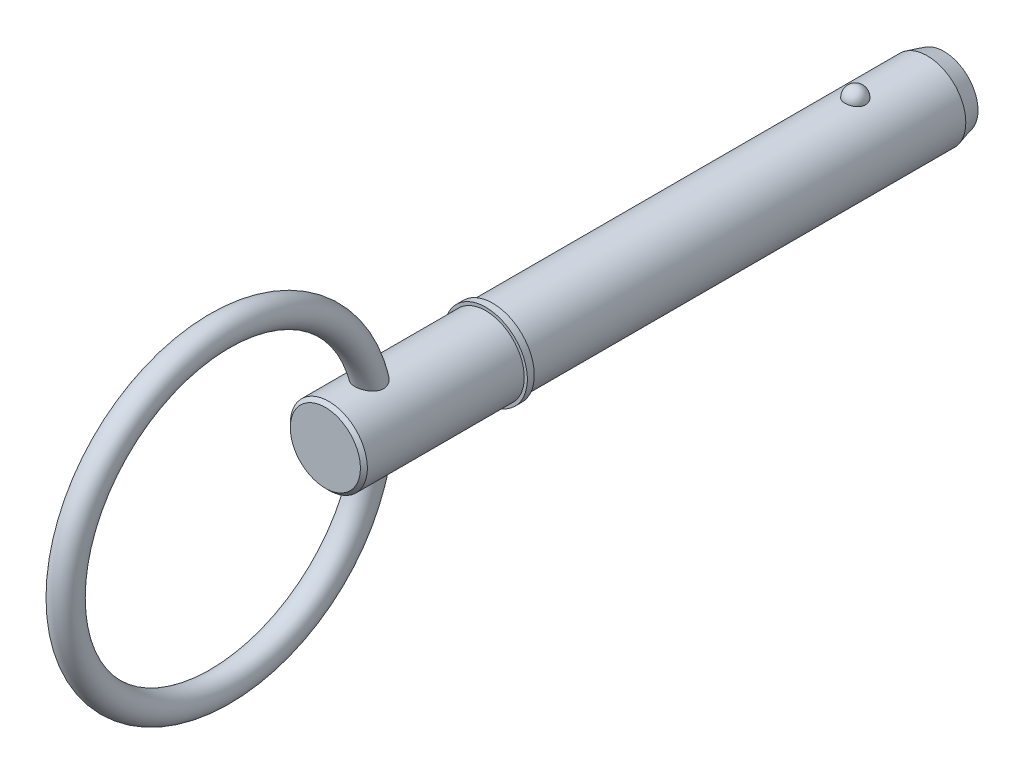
ISO-10303-21;
HEADER;
FILE_DESCRIPTION(('STEP AP214'),'2;1');
FILE_NAME('part.step','',(''),(''),'','','');
FILE_SCHEMA(('AUTOMOTIVE_DESIGN { 1 0 10303 214 1 1 1 1 }'));
ENDSEC;
DATA;
#1=APPLICATION_CONTEXT('core data for automotive mechanical design processes');
#2=APPLICATION_PROTOCOL_DEFINITION('international standard','automotive_design',2000,#1);
#3=PRODUCT_CONTEXT('',#1,'mechanical');
#4=PRODUCT('Part','Part','',(#3));
#5=PRODUCT_RELATED_PRODUCT_CATEGORY('part','',(#4));
#6=PRODUCT_DEFINITION_FORMATION('','',#4);
#7=PRODUCT_DEFINITION_CONTEXT('part definition',#1,'design');
#8=PRODUCT_DEFINITION('design','',#6,#7);
#9=PRODUCT_DEFINITION_SHAPE('','',#8);
#10=(LENGTH_UNIT() NAMED_UNIT(*) SI_UNIT(.MILLI.,.METRE.));
#11=(NAMED_UNIT(*) PLANE_ANGLE_UNIT() SI_UNIT($,.RADIAN.));
#12=(NAMED_UNIT(*) SI_UNIT($,.STERADIAN.) SOLID_ANGLE_UNIT());
#13=UNCERTAINTY_MEASURE_WITH_UNIT(LENGTH_MEASURE(1.E-05),#10,'distance_accuracy_value','');
#14=(GEOMETRIC_REPRESENTATION_CONTEXT(3) GLOBAL_UNCERTAINTY_ASSIGNED_CONTEXT((#13)) GLOBAL_UNIT_ASSIGNED_CONTEXT((#10,
#11,#12)) REPRESENTATION_CONTEXT('',''));
#15=CARTESIAN_POINT('',(0.,0.,0.));
#16=DIRECTION('',(0.,0.,1.));
#17=DIRECTION('',(1.,0.,0.));
#18=AXIS2_PLACEMENT_3D('',#15,#16,#17);
#19=CARTESIAN_POINT('',(0.,0.,50.8));
#20=DIRECTION('',(0.,0.,-1.));
#21=DIRECTION('',(-1.,0.,0.));
#22=AXIS2_PLACEMENT_3D('',#19,#20,#21);
#23=CYLINDRICAL_SURFACE('',#22,5.555);
#24=CARTESIAN_POINT('',(1.47653932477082,5.35517101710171,-1.49));
#25=CARTESIAN_POINT('',(1.4765376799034,5.35517235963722,-1.40667872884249));
#26=CARTESIAN_POINT('',(1.4697233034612,5.35706459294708,-1.32333626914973));
#27=CARTESIAN_POINT('',(1.4426291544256,5.36442332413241,-1.15900769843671));
#28=CARTESIAN_POINT('',(1.42234344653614,5.36989139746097,-1.07802264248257));
#29=CARTESIAN_POINT('',(1.36882802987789,5.38378061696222,-0.920757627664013));
#30=CARTESIAN_POINT('',(1.33560404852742,5.39220045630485,-0.844475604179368));
#31=CARTESIAN_POINT('',(1.25704906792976,5.41105136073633,-0.69870312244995));
#32=CARTESIAN_POINT('',(1.21171855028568,5.42148234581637,-0.62921239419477));
#33=CARTESIAN_POINT('',(1.10986325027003,5.44324765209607,-0.498626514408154));
#34=CARTESIAN_POINT('',(1.05328868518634,5.45458585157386,-0.43757082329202));
#35=CARTESIAN_POINT('',(0.930545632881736,5.4768596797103,-0.325918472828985));
#36=CARTESIAN_POINT('',(0.864377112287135,5.48779530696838,-0.275321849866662));
#37=CARTESIAN_POINT('',(0.724412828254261,5.50801510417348,-0.186125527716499));
#38=CARTESIAN_POINT('',(0.650637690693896,5.51730356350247,-0.147494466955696));
#39=CARTESIAN_POINT('',(0.497383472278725,5.53322345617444,-0.0831582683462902));
#40=CARTESIAN_POINT('',(0.417904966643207,5.53985515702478,-0.0574518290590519));
#41=CARTESIAN_POINT('',(0.256903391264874,5.54963245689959,-0.0200294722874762));
#42=CARTESIAN_POINT('',(0.17543580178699,5.55283384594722,-0.00808940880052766));
#43=CARTESIAN_POINT('',(0.011588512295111,5.55559187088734,0.00221439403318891));
#44=CARTESIAN_POINT('',(-0.0707911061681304,5.55514883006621,0.000579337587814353));
#45=CARTESIAN_POINT('',(-0.232980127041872,5.55069756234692,-0.0161051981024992));
#46=CARTESIAN_POINT('',(-0.312809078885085,5.54673626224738,-0.0309781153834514));
#47=CARTESIAN_POINT('',(-0.468771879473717,5.5357377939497,-0.0734743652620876));
#48=CARTESIAN_POINT('',(-0.544905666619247,5.52870057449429,-0.101097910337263));
#49=CARTESIAN_POINT('',(-0.691800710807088,5.51225307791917,-0.168516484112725));
#50=CARTESIAN_POINT('',(-0.762530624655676,5.50283015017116,-0.208376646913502));
#51=CARTESIAN_POINT('',(-0.896294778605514,5.48263289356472,-0.299136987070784));
#52=CARTESIAN_POINT('',(-0.959328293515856,5.47185843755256,-0.350038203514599));
#53=CARTESIAN_POINT('',(-1.07712789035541,5.44990641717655,-0.462517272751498));
#54=CARTESIAN_POINT('',(-1.13172901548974,5.43872509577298,-0.524267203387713));
#55=CARTESIAN_POINT('',(-1.2299173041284,5.41736658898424,-0.6561336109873));
#56=CARTESIAN_POINT('',(-1.2735037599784,5.40718946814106,-0.726250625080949));
#57=CARTESIAN_POINT('',(-1.34896420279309,5.38886361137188,-0.873713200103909));
#58=CARTESIAN_POINT('',(-1.38071142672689,5.38073711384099,-0.951126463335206));
#59=CARTESIAN_POINT('',(-1.4310375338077,5.36757288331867,-1.11037033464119));
#60=CARTESIAN_POINT('',(-1.44961676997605,5.3625350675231,-1.19220082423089));
#61=CARTESIAN_POINT('',(-1.47308754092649,5.35613553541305,-1.35761209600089));
#62=CARTESIAN_POINT('',(-1.47803294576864,5.35475935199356,-1.44118467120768));
#63=CARTESIAN_POINT('',(-1.47426441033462,5.35579807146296,-1.6079958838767));
#64=CARTESIAN_POINT('',(-1.46555080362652,5.35821288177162,-1.69123452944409));
#65=CARTESIAN_POINT('',(-1.43475662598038,5.36653964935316,-1.8546288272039));
#66=CARTESIAN_POINT('',(-1.41273621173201,5.37243586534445,-1.93479663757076));
#67=CARTESIAN_POINT('',(-1.35593151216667,5.38705199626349,-2.0902011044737));
#68=CARTESIAN_POINT('',(-1.32114675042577,5.39577201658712,-2.16543757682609));
#69=CARTESIAN_POINT('',(-1.23947506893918,5.41511674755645,-2.30926926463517));
#70=CARTESIAN_POINT('',(-1.1925277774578,5.42575087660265,-2.37782893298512));
#71=CARTESIAN_POINT('',(-1.08780725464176,5.44771095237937,-2.50598876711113));
#72=CARTESIAN_POINT('',(-1.03003365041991,5.4590369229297,-2.56558862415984));
#73=CARTESIAN_POINT('',(-0.90495349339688,5.48116073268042,-2.67436535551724));
#74=CARTESIAN_POINT('',(-0.837616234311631,5.49195671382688,-2.7235073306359));
#75=CARTESIAN_POINT('',(-0.69537970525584,5.51177099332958,-2.8097317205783));
#76=CARTESIAN_POINT('',(-0.620480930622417,5.52078940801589,-2.84681492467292));
#77=CARTESIAN_POINT('',(-0.466144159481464,5.53594369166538,-2.90749751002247));
#78=CARTESIAN_POINT('',(-0.386768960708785,5.54211181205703,-2.93124844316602));
#79=CARTESIAN_POINT('',(-0.224991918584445,5.5510324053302,-2.96523308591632));
#80=CARTESIAN_POINT('',(-0.142590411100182,5.55378525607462,-2.97546829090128));
#81=CARTESIAN_POINT('',(0.0213711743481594,5.55555351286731,-2.98206550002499));
#82=CARTESIAN_POINT('',(0.102921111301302,5.55463281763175,-2.97866468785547));
#83=CARTESIAN_POINT('',(0.2642564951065,5.54929804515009,-2.95862186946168));
#84=CARTESIAN_POINT('',(0.344041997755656,5.54488407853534,-2.94198028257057));
#85=CARTESIAN_POINT('',(0.499344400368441,5.53305794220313,-2.89600357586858));
#86=CARTESIAN_POINT('',(0.574874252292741,5.52565550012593,-2.86670961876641));
#87=CARTESIAN_POINT('',(0.71989857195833,5.50863937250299,-2.79624249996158));
#88=CARTESIAN_POINT('',(0.78939269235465,5.49902555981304,-2.75506865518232));
#89=CARTESIAN_POINT('',(0.921480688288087,5.47845199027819,-2.66127110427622));
#90=CARTESIAN_POINT('',(0.983960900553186,5.46747485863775,-2.60849118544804));
#91=CARTESIAN_POINT('',(1.09925057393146,5.44546837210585,-2.49325304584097));
#92=CARTESIAN_POINT('',(1.15205830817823,5.43443900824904,-2.43079310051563));
#93=CARTESIAN_POINT('',(1.24742943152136,5.41335152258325,-2.29680711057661));
#94=CARTESIAN_POINT('',(1.28981661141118,5.40331162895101,-2.22515272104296));
#95=CARTESIAN_POINT('',(1.36214937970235,5.38553336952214,-2.07558035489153));
#96=CARTESIAN_POINT('',(1.39210034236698,5.37779400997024,-1.99766510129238));
#97=CARTESIAN_POINT('',(1.43569518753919,5.36630594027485,-1.84848338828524));
#98=CARTESIAN_POINT('',(1.45098536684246,5.36216169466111,-1.77772322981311));
#99=CARTESIAN_POINT('',(1.47140805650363,5.35659367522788,-1.63464735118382));
#100=CARTESIAN_POINT('',(1.47654075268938,5.35516985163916,-1.56233165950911));
#101=CARTESIAN_POINT('',(1.47653932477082,5.35517101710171,-1.49));
#102=B_SPLINE_CURVE_WITH_KNOTS('',3,(#24,#25,#26,#27,#28,#29,#30,#31,#32,#33,#34,#35,#36,#37,
#38,#39,#40,#41,#42,#43,#44,#45,#46,#47,#48,#49,#50,#51,#52,#53,#54,#55,#56,#57,#58,#59,#60,#61,
#62,#63,#64,#65,#66,#67,#68,#69,#70,#71,#72,#73,#74,#75,#76,#77,#78,#79,#80,#81,#82,#83,#84,#85,
#86,#87,#88,#89,#90,#91,#92,#93,#94,#95,#96,#97,#98,#99,#100,#101),.UNSPECIFIED.,.T.,.F.,(4,2,2,
2,2,2,2,2,2,2,2,2,2,2,2,2,2,2,2,2,2,2,2,2,2,2,2,2,2,2,2,2,2,2,2,2,2,2,4),(0.,0.249703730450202,
0.4995175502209,0.749220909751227,0.998914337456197,1.24973894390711,1.50056442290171,
1.75072681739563,2.00086401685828,2.24686822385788,2.49285060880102,2.73560052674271,
2.97835449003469,3.22242369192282,3.46651587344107,3.71490232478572,3.96330473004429,
4.21429522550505,4.46527899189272,4.71526963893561,4.96525418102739,5.21411697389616,
5.46298905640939,5.71312097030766,5.96326150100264,6.21422412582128,6.46517032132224,
6.71320296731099,6.96120816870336,7.20491846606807,7.44862104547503,7.69153667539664,
7.93446627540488,8.18089104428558,8.42735976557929,8.67774679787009,8.92802551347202,
9.14479867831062,9.36156787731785),.UNSPECIFIED.);
#103=CARTESIAN_POINT('',(1.47653932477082,5.35517101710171,-1.49));
#104=VERTEX_POINT('',#103);
#105=EDGE_CURVE('E103',#104,#104,#102,.T.);
#106=ORIENTED_EDGE('',*,*,#105,.T.);
#107=EDGE_LOOP('',(#106));
#108=FACE_BOUND('',#107,.T.);
#109=CARTESIAN_POINT('',(0.,0.,-11.87));
#110=DIRECTION('',(0.,0.,-1.));
#111=DIRECTION('',(-1.,0.,0.));
#112=AXIS2_PLACEMENT_3D('',#109,#110,#111);
#113=CIRCLE('',#112,5.555);
#114=CARTESIAN_POINT('',(5.555,0.,-11.87));
#115=VERTEX_POINT('',#114);
#116=EDGE_CURVE('E111',#115,#115,#113,.F.);
#117=ORIENTED_EDGE('',*,*,#116,.T.);
#118=EDGE_LOOP('',(#117));
#119=FACE_BOUND('',#118,.T.);
#120=CARTESIAN_POINT('',(0.,0.,50.8));
#121=DIRECTION('',(0.,0.,1.));
#122=DIRECTION('',(1.,0.,0.));
#123=AXIS2_PLACEMENT_3D('',#120,#121,#122);
#124=CIRCLE('',#123,5.555);
#125=CARTESIAN_POINT('',(5.555,0.,50.8));
#126=VERTEX_POINT('',#125);
#127=EDGE_CURVE('E109',#126,#126,#124,.T.);
#128=ORIENTED_EDGE('',*,*,#127,.F.);
#129=EDGE_LOOP('',(#128));
#130=FACE_BOUND('',#129,.T.);
#131=ADVANCED_FACE('F39',(#108,#119,#130),#23,.T.);
#132=CARTESIAN_POINT('',(0.,0.,-14.27));
#133=DIRECTION('',(0.,0.,-1.));
#134=DIRECTION('',(-1.,0.,0.));
#135=AXIS2_PLACEMENT_3D('',#132,#133,#134);
#136=PLANE('',#135);
#137=CARTESIAN_POINT('',(0.,0.,-14.27));
#138=DIRECTION('',(0.,0.,-1.));
#139=DIRECTION('',(-1.,0.,0.));
#140=AXIS2_PLACEMENT_3D('',#137,#138,#139);
#141=CIRCLE('',#140,4.91192193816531);
#142=CARTESIAN_POINT('',(4.91192193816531,0.,-14.27));
#143=VERTEX_POINT('',#142);
#144=EDGE_CURVE('E142',#143,#143,#141,.T.);
#145=ORIENTED_EDGE('',*,*,#144,.T.);
#146=EDGE_LOOP('',(#145));
#147=FACE_BOUND('',#146,.T.);
#148=ADVANCED_FACE('F89',(#147),#136,.T.);
#149=CARTESIAN_POINT('',(0.,0.,-14.27));
#150=DIRECTION('',(0.,0.,1.));
#151=DIRECTION('',(1.,0.,0.));
#152=AXIS2_PLACEMENT_3D('',#149,#150,#151);
#153=CONICAL_SURFACE('',#152,4.91192193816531,0.261799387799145);
#154=CARTESIAN_POINT('',(5.555,0.,-11.87));
#155=CARTESIAN_POINT('',(5.54830127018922,0.,-11.895));
#156=CARTESIAN_POINT('',(5.54160254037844,0.,-11.92));
#157=CARTESIAN_POINT('',(5.52820508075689,0.,-11.97));
#158=CARTESIAN_POINT('',(5.52150635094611,0.,-11.995));
#159=CARTESIAN_POINT('',(5.50810889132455,0.,-12.045));
#160=CARTESIAN_POINT('',(5.50141016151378,0.,-12.07));
#161=CARTESIAN_POINT('',(5.48801270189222,0.,-12.12));
#162=CARTESIAN_POINT('',(5.48131397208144,0.,-12.145));
#163=CARTESIAN_POINT('',(5.46791651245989,0.,-12.195));
#164=CARTESIAN_POINT('',(5.46121778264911,0.,-12.22));
#165=CARTESIAN_POINT('',(5.44782032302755,0.,-12.27));
#166=CARTESIAN_POINT('',(5.44112159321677,0.,-12.295));
#167=CARTESIAN_POINT('',(5.42772413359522,0.,-12.345));
#168=CARTESIAN_POINT('',(5.42102540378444,0.,-12.37));
#169=CARTESIAN_POINT('',(5.40762794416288,0.,-12.42));
#170=CARTESIAN_POINT('',(5.40092921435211,0.,-12.445));
#171=CARTESIAN_POINT('',(5.38753175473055,0.,-12.495));
#172=CARTESIAN_POINT('',(5.38083302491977,0.,-12.52));
#173=CARTESIAN_POINT('',(5.36743556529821,0.,-12.57));
#174=CARTESIAN_POINT('',(5.36073683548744,0.,-12.595));
#175=CARTESIAN_POINT('',(5.34733937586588,0.,-12.645));
#176=CARTESIAN_POINT('',(5.3406406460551,0.,-12.67));
#177=CARTESIAN_POINT('',(5.32724318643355,0.,-12.72));
#178=CARTESIAN_POINT('',(5.32054445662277,0.,-12.745));
#179=CARTESIAN_POINT('',(5.30714699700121,0.,-12.795));
#180=CARTESIAN_POINT('',(5.30044826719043,0.,-12.82));
#181=CARTESIAN_POINT('',(5.28705080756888,0.,-12.87));
#182=CARTESIAN_POINT('',(5.2803520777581,0.,-12.895));
#183=CARTESIAN_POINT('',(5.26695461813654,0.,-12.945));
#184=CARTESIAN_POINT('',(5.26025588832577,0.,-12.97));
#185=CARTESIAN_POINT('',(5.24685842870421,0.,-13.02));
#186=CARTESIAN_POINT('',(5.24015969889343,0.,-13.045));
#187=CARTESIAN_POINT('',(5.22676223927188,0.,-13.095));
#188=CARTESIAN_POINT('',(5.2200635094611,0.,-13.12));
#189=CARTESIAN_POINT('',(5.20666604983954,0.,-13.17));
#190=CARTESIAN_POINT('',(5.19996732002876,0.,-13.195));
#191=CARTESIAN_POINT('',(5.18656986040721,0.,-13.245));
#192=CARTESIAN_POINT('',(5.17987113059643,0.,-13.27));
#193=CARTESIAN_POINT('',(5.16647367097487,0.,-13.32));
#194=CARTESIAN_POINT('',(5.1597749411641,0.,-13.345));
#195=CARTESIAN_POINT('',(5.14637748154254,0.,-13.395));
#196=CARTESIAN_POINT('',(5.13967875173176,0.,-13.42));
#197=CARTESIAN_POINT('',(5.12628129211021,0.,-13.47));
#198=CARTESIAN_POINT('',(5.11958256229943,0.,-13.495));
#199=CARTESIAN_POINT('',(5.10618510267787,0.,-13.545));
#200=CARTESIAN_POINT('',(5.09948637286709,0.,-13.57));
#201=CARTESIAN_POINT('',(5.08608891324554,0.,-13.62));
#202=CARTESIAN_POINT('',(5.07939018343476,0.,-13.645));
#203=CARTESIAN_POINT('',(5.0659927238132,0.,-13.695));
#204=CARTESIAN_POINT('',(5.05929399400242,0.,-13.72));
#205=CARTESIAN_POINT('',(5.04589653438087,0.,-13.77));
#206=CARTESIAN_POINT('',(5.03919780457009,0.,-13.795));
#207=CARTESIAN_POINT('',(5.02580034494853,0.,-13.845));
#208=CARTESIAN_POINT('',(5.01910161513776,0.,-13.87));
#209=CARTESIAN_POINT('',(5.0057041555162,0.,-13.92));
#210=CARTESIAN_POINT('',(4.99900542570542,0.,-13.945));
#211=CARTESIAN_POINT('',(4.98560796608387,0.,-13.995));
#212=CARTESIAN_POINT('',(4.97890923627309,0.,-14.02));
#213=CARTESIAN_POINT('',(4.96551177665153,0.,-14.07));
#214=CARTESIAN_POINT('',(4.95881304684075,0.,-14.095));
#215=CARTESIAN_POINT('',(4.9454155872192,0.,-14.145));
#216=CARTESIAN_POINT('',(4.93871685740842,0.,-14.17));
#217=CARTESIAN_POINT('',(4.92531939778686,0.,-14.22));
#218=CARTESIAN_POINT('',(4.91862066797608,0.,-14.245));
#219=CARTESIAN_POINT('',(4.91192193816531,0.,-14.27));
#220=B_SPLINE_CURVE_WITH_KNOTS('',3,(#154,#155,#156,#157,#158,#159,#160,#161,#162,#163,#164,
#165,#166,#167,#168,#169,#170,#171,#172,#173,#174,#175,#176,#177,#178,#179,#180,#181,#182,#183,
#184,#185,#186,#187,#188,#189,#190,#191,#192,#193,#194,#195,#196,#197,#198,#199,#200,#201,#202,
#203,#204,#205,#206,#207,#208,#209,#210,#211,#212,#213,#214,#215,#216,#217,#218,#219),
.UNSPECIFIED.,.F.,.F.,(4,2,2,2,2,2,2,2,2,2,2,2,2,2,2,2,2,2,2,2,2,2,2,2,2,2,2,2,2,2,2,2,4),(0.,
0.0776457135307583,0.155291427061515,0.232937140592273,0.31058285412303,0.388228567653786,
0.465874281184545,0.543519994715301,0.621165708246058,0.698811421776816,0.776457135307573,
0.854102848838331,0.931748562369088,1.00939427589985,1.0870399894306,1.16468570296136,
1.24233141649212,1.31997713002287,1.39762284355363,1.47526855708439,1.55291427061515,
1.6305599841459,1.70820569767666,1.78585141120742,1.86349712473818,1.94114283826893,
2.01878855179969,2.09643426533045,2.17407997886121,2.25172569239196,2.32937140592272,
2.40701711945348,2.48466283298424),.UNSPECIFIED.);
#221=EDGE_CURVE('BSEAM95',#115,#143,#220,.T.);
#222=ORIENTED_EDGE('',*,*,#116,.F.);
#223=ORIENTED_EDGE('',*,*,#144,.F.);
#224=ORIENTED_EDGE('',*,*,#221,.T.);
#225=ORIENTED_EDGE('',*,*,#221,.F.);
#226=EDGE_LOOP('',(#222,#224,#223,#225));
#227=FACE_BOUND('',#226,.T.);
#228=ADVANCED_FACE('F95',(#227),#153,.T.);
#229=CARTESIAN_POINT('',(0.,5.555,-1.49));
#230=DIRECTION('',(0.,1.,0.));
#231=DIRECTION('',(0.,0.,1.));
#232=AXIS2_PLACEMENT_3D('',#229,#230,#231);
#233=SPHERICAL_SURFACE('',#232,1.49);
#234=ORIENTED_EDGE('',*,*,#105,.F.);
#235=EDGE_LOOP('',(#234));
#236=FACE_BOUND('',#235,.T.);
#237=ADVANCED_FACE('F114',(#236),#233,.T.);
#238=CARTESIAN_POINT('',(0.,0.,50.8));
#239=DIRECTION('',(0.,0.,-1.));
#240=DIRECTION('',(-1.,0.,0.));
#241=AXIS2_PLACEMENT_3D('',#238,#239,#240);
#242=PLANE('',#241);
#243=ORIENTED_EDGE('',*,*,#127,.T.);
#244=EDGE_LOOP('',(#243));
#245=FACE_BOUND('',#244,.T.);
#246=CARTESIAN_POINT('',(0.,0.,50.8));
#247=DIRECTION('',(0.,0.,-1.));
#248=DIRECTION('',(-1.,0.,0.));
#249=AXIS2_PLACEMENT_3D('',#246,#247,#248);
#250=CIRCLE('',#249,6.);
#251=CARTESIAN_POINT('',(-6.,0.,50.8));
#252=VERTEX_POINT('',#251);
#253=EDGE_CURVE('E110',#252,#252,#250,.T.);
#254=ORIENTED_EDGE('',*,*,#253,.T.);
#255=EDGE_LOOP('',(#254));
#256=FACE_BOUND('',#255,.T.);
#257=ADVANCED_FACE('F118',(#245,#256),#242,.T.);
#258=CARTESIAN_POINT('',(0.,0.,33.7287874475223));
#259=DIRECTION('',(0.,0.,-1.));
#260=DIRECTION('',(-1.,0.,0.));
#261=AXIS2_PLACEMENT_3D('',#258,#259,#260);
#262=CYLINDRICAL_SURFACE('',#261,6.);
#263=CARTESIAN_POINT('',(0.,0.,51.8));
#264=DIRECTION('',(0.,0.,-1.));
#265=DIRECTION('',(-1.,0.,0.));
#266=AXIS2_PLACEMENT_3D('',#263,#264,#265);
#267=CIRCLE('',#266,6.);
#268=CARTESIAN_POINT('',(-6.,0.,51.8));
#269=VERTEX_POINT('',#268);
#270=EDGE_CURVE('E135',#269,#269,#267,.T.);
#271=ORIENTED_EDGE('',*,*,#270,.T.);
#272=EDGE_LOOP('',(#271));
#273=FACE_BOUND('',#272,.T.);
#274=ORIENTED_EDGE('',*,*,#253,.F.);
#275=EDGE_LOOP('',(#274));
#276=FACE_BOUND('',#275,.T.);
#277=ADVANCED_FACE('F122',(#273,#276),#262,.T.);
#278=CARTESIAN_POINT('',(0.,6.,51.8));
#279=DIRECTION('',(0.,0.,1.));
#280=DIRECTION('',(1.,0.,0.));
#281=AXIS2_PLACEMENT_3D('',#278,#279,#280);
#282=PLANE('',#281);
#283=CARTESIAN_POINT('',(0.,0.,51.8));
#284=DIRECTION('',(0.,0.,1.));
#285=DIRECTION('',(1.,0.,0.));
#286=AXIS2_PLACEMENT_3D('',#283,#284,#285);
#287=CIRCLE('',#286,5.555);
#288=CARTESIAN_POINT('',(5.555,0.,51.8));
#289=VERTEX_POINT('',#288);
#290=EDGE_CURVE('E113',#289,#289,#287,.T.);
#291=ORIENTED_EDGE('',*,*,#290,.F.);
#292=EDGE_LOOP('',(#291));
#293=FACE_BOUND('',#292,.T.);
#294=ORIENTED_EDGE('',*,*,#270,.F.);
#295=EDGE_LOOP('',(#294));
#296=FACE_BOUND('',#295,.T.);
#297=ADVANCED_FACE('F86',(#293,#296),#282,.T.);
#298=CARTESIAN_POINT('',(0.,0.,74.93));
#299=DIRECTION('',(0.,0.,-1.));
#300=DIRECTION('',(-1.,0.,0.));
#301=AXIS2_PLACEMENT_3D('',#298,#299,#300);
#302=CYLINDRICAL_SURFACE('',#301,5.555);
#303=CARTESIAN_POINT('',(-0.961380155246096,-5.47117658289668,66.8087332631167));
#304=CARTESIAN_POINT('',(-0.863231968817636,-5.48842171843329,66.7575155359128));
#305=CARTESIAN_POINT('',(-0.7605484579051,-5.50372118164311,66.7143181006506));
#306=CARTESIAN_POINT('',(-0.548956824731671,-5.52883500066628,66.6449127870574));
#307=CARTESIAN_POINT('',(-0.440048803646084,-5.53864944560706,66.6187046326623));
#308=CARTESIAN_POINT('',(-0.219033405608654,-5.55178384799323,66.5838646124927));
#309=CARTESIAN_POINT('',(-0.106925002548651,-5.55510169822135,66.5752384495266));
#310=CARTESIAN_POINT('',(0.11723899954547,-5.55489351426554,66.5757834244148));
#311=CARTESIAN_POINT('',(0.229294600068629,-5.55136768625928,66.5849540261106));
#312=CARTESIAN_POINT('',(0.449588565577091,-5.5378711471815,66.6207847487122));
#313=CARTESIAN_POINT('',(0.557843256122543,-5.52793284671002,66.647356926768));
#314=CARTESIAN_POINT('',(0.768116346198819,-5.50265785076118,66.7173095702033));
#315=CARTESIAN_POINT('',(0.87013418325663,-5.48732066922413,66.7606915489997));
#316=CARTESIAN_POINT('',(1.06580880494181,-5.45270790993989,66.8636854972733));
#317=CARTESIAN_POINT('',(1.1594033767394,-5.43340601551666,66.9234068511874));
#318=CARTESIAN_POINT('',(1.33484934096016,-5.39298781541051,67.0576727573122));
#319=CARTESIAN_POINT('',(1.41670019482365,-5.37187142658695,67.1322179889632));
#320=CARTESIAN_POINT('',(1.5662865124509,-5.33017932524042,67.2944337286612));
#321=CARTESIAN_POINT('',(1.63402728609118,-5.30960341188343,67.3820992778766));
#322=CARTESIAN_POINT('',(1.75338323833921,-5.27139606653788,67.56835593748));
#323=CARTESIAN_POINT('',(1.80500413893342,-5.25376359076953,67.6669431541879));
#324=CARTESIAN_POINT('',(1.88923054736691,-5.22405733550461,67.8688661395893));
#325=CARTESIAN_POINT('',(1.92240068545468,-5.21182119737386,67.9719426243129));
#326=CARTESIAN_POINT('',(1.97156802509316,-5.19342304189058,68.1826121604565));
#327=CARTESIAN_POINT('',(1.98756752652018,-5.18726021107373,68.2902046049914));
#328=CARTESIAN_POINT('',(2.00238957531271,-5.1815556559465,68.5048133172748));
#329=CARTESIAN_POINT('',(2.0015062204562,-5.18190056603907,68.6118070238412));
#330=CARTESIAN_POINT('',(1.98404322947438,-5.18861029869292,68.8242949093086));
#331=CARTESIAN_POINT('',(1.96745884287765,-5.19497694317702,68.92978862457));
#332=CARTESIAN_POINT('',(1.91810947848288,-5.21340722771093,69.1437346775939));
#333=CARTESIAN_POINT('',(1.88435438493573,-5.22581720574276,69.2519270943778));
#334=CARTESIAN_POINT('',(1.80161540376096,-5.25491400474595,69.4617187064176));
#335=CARTESIAN_POINT('',(1.75262312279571,-5.27160318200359,69.5633142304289));
#336=CARTESIAN_POINT('',(1.63431251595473,-5.30955034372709,69.7688565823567));
#337=CARTESIAN_POINT('',(1.56333412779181,-5.33111051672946,69.8717964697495));
#338=CARTESIAN_POINT('',(1.40529607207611,-5.37493145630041,70.0644716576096));
#339=CARTESIAN_POINT('',(1.31822569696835,-5.39719268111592,70.1541980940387));
#340=CARTESIAN_POINT('',(1.12728892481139,-5.44031451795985,70.3190042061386));
#341=CARTESIAN_POINT('',(1.02309899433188,-5.46113424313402,70.393723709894));
#342=CARTESIAN_POINT('',(0.801576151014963,-5.49800171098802,70.5218052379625));
#343=CARTESIAN_POINT('',(0.684264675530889,-5.51405708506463,70.575201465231));
#344=CARTESIAN_POINT('',(0.456877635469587,-5.53719478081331,70.650980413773));
#345=CARTESIAN_POINT('',(0.34797457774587,-5.54519800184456,70.6765844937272));
#346=CARTESIAN_POINT('',(0.12704223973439,-5.55464249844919,70.7067313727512));
#347=CARTESIAN_POINT('',(0.0150164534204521,-5.55609083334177,70.711296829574));
#348=CARTESIAN_POINT('',(-0.191993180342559,-5.55250986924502,70.6999113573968));
#349=CARTESIAN_POINT('',(-0.287160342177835,-5.54836194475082,70.6867524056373));
#350=CARTESIAN_POINT('',(-0.473863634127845,-5.53554271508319,70.6454897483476));
#351=CARTESIAN_POINT('',(-0.565399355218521,-5.52687090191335,70.6173843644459));
#352=CARTESIAN_POINT('',(-0.743786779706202,-5.50572322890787,70.547293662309));
#353=CARTESIAN_POINT('',(-0.830566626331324,-5.49320168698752,70.5051411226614));
#354=CARTESIAN_POINT('',(-0.996720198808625,-5.46549909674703,70.408875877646));
#355=CARTESIAN_POINT('',(-1.07609119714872,-5.45031707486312,70.3547587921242));
#356=CARTESIAN_POINT('',(-1.23672272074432,-5.41628785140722,70.2282113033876));
#357=CARTESIAN_POINT('',(-1.3167603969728,-5.39722327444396,70.1542891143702));
#358=CARTESIAN_POINT('',(-1.46504263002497,-5.3588760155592,69.995462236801));
#359=CARTESIAN_POINT('',(-1.53327828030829,-5.33959318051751,69.9105493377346));
#360=CARTESIAN_POINT('',(-1.66602271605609,-5.29979878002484,69.7186972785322));
#361=CARTESIAN_POINT('',(-1.72857256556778,-5.27951148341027,69.6103478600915));
#362=CARTESIAN_POINT('',(-1.83559571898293,-5.24326402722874,69.3843258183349));
#363=CARTESIAN_POINT('',(-1.88006296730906,-5.22730531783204,69.2666500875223));
#364=CARTESIAN_POINT('',(-1.94988009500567,-5.20167534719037,69.0220877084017));
#365=CARTESIAN_POINT('',(-1.97477410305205,-5.19215470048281,68.8950527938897));
#366=CARTESIAN_POINT('',(-2.00168294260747,-5.18184594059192,68.6382494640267));
#367=CARTESIAN_POINT('',(-2.0037221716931,-5.18104851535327,68.5084841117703));
#368=CARTESIAN_POINT('',(-1.98467753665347,-5.18836681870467,68.2646529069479));
#369=CARTESIAN_POINT('',(-1.96600067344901,-5.19555485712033,68.1503700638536));
#370=CARTESIAN_POINT('',(-1.90923541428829,-5.21668050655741,67.927389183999));
#371=CARTESIAN_POINT('',(-1.87115335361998,-5.23061591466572,67.8186893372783));
#372=CARTESIAN_POINT('',(-1.78015350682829,-5.26224244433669,67.6183712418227));
#373=CARTESIAN_POINT('',(-1.72857344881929,-5.27957041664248,67.5260829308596));
#374=CARTESIAN_POINT('',(-1.61106729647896,-5.31660340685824,67.3516847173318));
#375=CARTESIAN_POINT('',(-1.54514024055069,-5.33630858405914,67.2695754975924));
#376=CARTESIAN_POINT('',(-1.39929408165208,-5.37641320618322,67.115887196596));
#377=CARTESIAN_POINT('',(-1.31912544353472,-5.39681868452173,67.0445467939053));
#378=CARTESIAN_POINT('',(-1.14786008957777,-5.43582099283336,66.9158557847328));
#379=CARTESIAN_POINT('',(-1.05676174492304,-5.4544175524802,66.8585072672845));
#380=CARTESIAN_POINT('',(-0.961380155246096,-5.47117658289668,66.8087332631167));
#381=B_SPLINE_CURVE_WITH_KNOTS('',3,(#303,#304,#305,#306,#307,#308,#309,#310,#311,#312,#313,
#314,#315,#316,#317,#318,#319,#320,#321,#322,#323,#324,#325,#326,#327,#328,#329,#330,#331,#332,
#333,#334,#335,#336,#337,#338,#339,#340,#341,#342,#343,#344,#345,#346,#347,#348,#349,#350,#351,
#352,#353,#354,#355,#356,#357,#358,#359,#360,#361,#362,#363,#364,#365,#366,#367,#368,#369,#370,
#371,#372,#373,#374,#375,#376,#377,#378,#379,#380),.UNSPECIFIED.,.T.,.F.,(4,2,2,2,2,2,2,2,2,2,2,
2,2,2,2,2,2,2,2,2,2,2,2,2,2,2,2,2,2,2,2,2,2,2,2,2,2,2,4),(0.,0.335747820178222,0.67149018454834,
1.0073414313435,1.3431825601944,1.6773394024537,2.01152633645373,2.3480076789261,
2.68450444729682,3.020874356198,3.35712472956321,3.68242216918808,4.0076760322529,
4.32726924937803,4.6469591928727,4.98762165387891,5.32847210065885,5.7074287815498,
6.08663853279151,6.47407889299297,6.86089527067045,7.19531213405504,7.52936875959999,
7.81649827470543,8.10366003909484,8.39437023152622,8.68518702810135,9.01572837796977,
9.34651809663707,9.72504519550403,10.1036989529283,10.4909301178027,10.8777478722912,
11.2239231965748,11.5699855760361,11.8899109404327,12.2098577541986,12.5360928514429,
12.8623766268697),.UNSPECIFIED.);
#382=CARTESIAN_POINT('',(-0.961380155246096,-5.47117658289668,66.8087332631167));
#383=VERTEX_POINT('',#382);
#384=EDGE_CURVE('E10',#383,#383,#381,.T.);
#385=ORIENTED_EDGE('',*,*,#384,.F.);
#386=EDGE_LOOP('',(#385));
#387=FACE_BOUND('',#386,.T.);
#388=CARTESIAN_POINT('',(-0.961380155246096,5.47117658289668,66.8087332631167));
#389=CARTESIAN_POINT('',(-1.05891474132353,5.45403910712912,66.8596311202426));
#390=CARTESIAN_POINT('',(-1.15197270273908,5.43497920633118,66.9184510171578));
#391=CARTESIAN_POINT('',(-1.32661268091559,5.39501222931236,67.0507016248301));
#392=CARTESIAN_POINT('',(-1.40819495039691,5.37410519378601,67.1241320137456));
#393=CARTESIAN_POINT('',(-1.55769110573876,5.33269731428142,67.284098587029));
#394=CARTESIAN_POINT('',(-1.62558729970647,5.3121970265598,67.3706514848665));
#395=CARTESIAN_POINT('',(-1.74556031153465,5.27399510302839,67.5546466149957));
#396=CARTESIAN_POINT('',(-1.7976419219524,5.25629262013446,67.6520855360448));
#397=CARTESIAN_POINT('',(-1.88339939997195,5.22617061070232,67.8525656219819));
#398=CARTESIAN_POINT('',(-1.91750373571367,5.21362983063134,67.9554052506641));
#399=CARTESIAN_POINT('',(-1.96852412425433,5.194582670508,68.1657781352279));
#400=CARTESIAN_POINT('',(-1.98544249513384,5.18807547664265,68.2733107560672));
#401=CARTESIAN_POINT('',(-2.00201964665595,5.18170011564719,68.4878197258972));
#402=CARTESIAN_POINT('',(-2.00199605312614,5.18170977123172,68.594768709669));
#403=CARTESIAN_POINT('',(-1.98621575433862,5.18777751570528,68.8073062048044));
#404=CARTESIAN_POINT('',(-1.97045441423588,5.19383738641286,68.9128943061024));
#405=CARTESIAN_POINT('',(-1.92280904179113,5.21167084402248,69.1269141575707));
#406=CARTESIAN_POINT('',(-1.88996782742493,5.22378174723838,69.2351030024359));
#407=CARTESIAN_POINT('',(-1.8090690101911,5.252344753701,69.445029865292));
#408=CARTESIAN_POINT('',(-1.76100319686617,5.26879919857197,69.546764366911));
#409=CARTESIAN_POINT('',(-1.64464870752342,5.30634509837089,69.7527880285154));
#410=CARTESIAN_POINT('',(-1.57469702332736,5.32774959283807,69.8560850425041));
#411=CARTESIAN_POINT('',(-1.41872356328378,5.37138743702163,70.0496881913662));
#412=CARTESIAN_POINT('',(-1.3326906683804,5.39362135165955,70.1399852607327));
#413=CARTESIAN_POINT('',(-1.14345202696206,5.43692909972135,70.3065572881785));
#414=CARTESIAN_POINT('',(-1.03986000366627,5.45795811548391,70.3824096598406));
#415=CARTESIAN_POINT('',(-0.819338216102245,5.49537389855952,70.5129167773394));
#416=CARTESIAN_POINT('',(-0.70242947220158,5.51176784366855,70.5676043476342));
#417=CARTESIAN_POINT('',(-0.475167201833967,5.53565843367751,70.6460220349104));
#418=CARTESIAN_POINT('',(-0.365997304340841,5.54404610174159,70.6728937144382));
#419=CARTESIAN_POINT('',(-0.144272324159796,5.55422966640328,70.7054265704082));
#420=CARTESIAN_POINT('',(-0.031721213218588,5.55603301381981,70.7111117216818));
#421=CARTESIAN_POINT('',(0.176166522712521,5.55303883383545,70.7015929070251));
#422=CARTESIAN_POINT('',(0.271662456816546,5.54914868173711,70.6892608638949));
#423=CARTESIAN_POINT('',(0.459140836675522,5.53678955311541,70.6495233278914));
#424=CARTESIAN_POINT('',(0.551122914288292,5.52832009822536,70.622116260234));
#425=CARTESIAN_POINT('',(0.730082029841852,5.50755841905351,70.5534371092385));
#426=CARTESIAN_POINT('',(0.817013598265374,5.49523641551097,70.5120568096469));
#427=CARTESIAN_POINT('',(0.98356924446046,5.46788364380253,70.4172936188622));
#428=CARTESIAN_POINT('',(1.06319070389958,5.45285191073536,70.3639064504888));
#429=CARTESIAN_POINT('',(1.22430017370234,5.4191117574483,70.2389828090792));
#430=CARTESIAN_POINT('',(1.30459540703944,5.40018081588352,70.1659703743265));
#431=CARTESIAN_POINT('',(1.45353150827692,5.3620139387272,70.0089433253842));
#432=CARTESIAN_POINT('',(1.52216366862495,5.3427777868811,69.9249205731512));
#433=CARTESIAN_POINT('',(1.65601602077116,5.30294271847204,69.7348114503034));
#434=CARTESIAN_POINT('',(1.71927851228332,5.28255425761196,69.6272944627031));
#435=CARTESIAN_POINT('',(1.82790996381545,5.24595721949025,69.4028474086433));
#436=CARTESIAN_POINT('',(1.8732722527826,5.22975020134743,69.2859138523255));
#437=CARTESIAN_POINT('',(1.94526503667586,5.20341207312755,69.0421941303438));
#438=CARTESIAN_POINT('',(1.97135787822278,5.1934564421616,68.9152273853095));
#439=CARTESIAN_POINT('',(2.00068973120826,5.18223330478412,68.658318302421));
#440=CARTESIAN_POINT('',(2.00395290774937,5.18095661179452,68.5283792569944));
#441=CARTESIAN_POINT('',(1.98717985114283,5.1874070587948,68.283763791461));
#442=CARTESIAN_POINT('',(1.96951989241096,5.19421607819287,68.1688994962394));
#443=CARTESIAN_POINT('',(1.91463360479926,5.2146960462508,67.9445890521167));
#444=CARTESIAN_POINT('',(1.87741409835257,5.22836460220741,67.8351410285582));
#445=CARTESIAN_POINT('',(1.78800305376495,5.25957304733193,67.6335428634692));
#446=CARTESIAN_POINT('',(1.73720600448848,5.27672774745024,67.5407093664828));
#447=CARTESIAN_POINT('',(1.62116201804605,5.3135255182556,67.3651218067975));
#448=CARTESIAN_POINT('',(1.55591428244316,5.33316872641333,67.2823683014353));
#449=CARTESIAN_POINT('',(1.41164041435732,5.37317145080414,67.1276485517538));
#450=CARTESIAN_POINT('',(1.33241957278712,5.39353732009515,67.0558657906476));
#451=CARTESIAN_POINT('',(1.16300716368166,5.43258596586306,66.9261126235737));
#452=CARTESIAN_POINT('',(1.07281393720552,5.45126848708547,66.8681443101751));
#453=CARTESIAN_POINT('',(0.880638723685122,5.48564753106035,66.7655070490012));
#454=CARTESIAN_POINT('',(0.77836470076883,5.50122427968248,66.7213437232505));
#455=CARTESIAN_POINT('',(0.567418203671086,5.52696543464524,66.6499735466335));
#456=CARTESIAN_POINT('',(0.458745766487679,5.53712987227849,66.6227665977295));
#457=CARTESIAN_POINT('',(0.23779150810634,5.55101406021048,66.5858797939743));
#458=CARTESIAN_POINT('',(0.12550171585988,5.55471842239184,66.5762417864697));
#459=CARTESIAN_POINT('',(-0.0992056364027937,5.55525045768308,66.5748490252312));
#460=CARTESIAN_POINT('',(-0.211623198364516,5.55207802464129,66.5830945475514));
#461=CARTESIAN_POINT('',(-0.43421780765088,5.53913427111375,66.617408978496));
#462=CARTESIAN_POINT('',(-0.544370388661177,5.52931142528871,66.6436170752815));
#463=CARTESIAN_POINT('',(-0.758352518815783,5.50404767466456,66.7133955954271));
#464=CARTESIAN_POINT('',(-0.862181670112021,5.48860641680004,66.7569671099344));
#465=CARTESIAN_POINT('',(-0.961380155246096,5.47117658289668,66.8087332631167));
#466=B_SPLINE_CURVE_WITH_KNOTS('',3,(#388,#389,#390,#391,#392,#393,#394,#395,#396,#397,#398,
#399,#400,#401,#402,#403,#404,#405,#406,#407,#408,#409,#410,#411,#412,#413,#414,#415,#416,#417,
#418,#419,#420,#421,#422,#423,#424,#425,#426,#427,#428,#429,#430,#431,#432,#433,#434,#435,#436,
#437,#438,#439,#440,#441,#442,#443,#444,#445,#446,#447,#448,#449,#450,#451,#452,#453,#454,#455,
#456,#457,#458,#459,#460,#461,#462,#463,#464,#465),.UNSPECIFIED.,.T.,.F.,(4,2,2,2,2,2,2,2,2,2,2,
2,2,2,2,2,2,2,2,2,2,2,2,2,2,2,2,2,2,2,2,2,2,2,2,2,2,2,4),(0.,0.333636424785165,
0.667265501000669,1.00132312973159,1.33527942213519,1.66086829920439,1.98641325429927,
2.30585509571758,2.62539104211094,2.96514840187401,3.30508930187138,3.68313901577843,
4.06145109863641,4.4495380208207,4.83702062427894,5.17316628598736,5.508931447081,
5.79666415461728,6.08442692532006,6.37447144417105,6.66461944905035,6.99384361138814,
7.32331250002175,7.70083591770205,8.07849989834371,8.46633986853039,8.85376924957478,
9.20110411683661,9.54831791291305,9.86844524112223,10.1885902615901,10.513611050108,
10.8386810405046,11.1745469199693,11.5104108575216,11.8470737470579,12.183741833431,
12.5230486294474,12.8623767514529),.UNSPECIFIED.);
#467=CARTESIAN_POINT('',(-0.961380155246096,5.47117658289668,66.8087332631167));
#468=VERTEX_POINT('',#467);
#469=EDGE_CURVE('E51',#468,#468,#466,.T.);
#470=ORIENTED_EDGE('',*,*,#469,.F.);
#471=EDGE_LOOP('',(#470));
#472=FACE_BOUND('',#471,.T.);
#473=CARTESIAN_POINT('',(0.,0.,74.43));
#474=DIRECTION('',(0.,0.,-1.));
#475=DIRECTION('',(-1.,0.,0.));
#476=AXIS2_PLACEMENT_3D('',#473,#474,#475);
#477=CIRCLE('',#476,5.555);
#478=CARTESIAN_POINT('',(-5.555,0.,74.43));
#479=VERTEX_POINT('',#478);
#480=EDGE_CURVE('E65',#479,#479,#477,.T.);
#481=ORIENTED_EDGE('',*,*,#480,.T.);
#482=EDGE_LOOP('',(#481));
#483=FACE_BOUND('',#482,.T.);
#484=ORIENTED_EDGE('',*,*,#290,.T.);
#485=EDGE_LOOP('',(#484));
#486=FACE_BOUND('',#485,.T.);
#487=ADVANCED_FACE('F70',(#387,#472,#483,#486),#302,.T.);
#488=CARTESIAN_POINT('',(0.,0.,74.93));
#489=DIRECTION('',(0.,0.,-1.));
#490=DIRECTION('',(-1.,0.,0.));
#491=AXIS2_PLACEMENT_3D('',#488,#489,#490);
#492=PLANE('',#491);
#493=CARTESIAN_POINT('',(0.,0.,74.93));
#494=DIRECTION('',(0.,0.,-1.));
#495=DIRECTION('',(-1.,0.,0.));
#496=AXIS2_PLACEMENT_3D('',#493,#494,#495);
#497=CIRCLE('',#496,5.05499999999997);
#498=CARTESIAN_POINT('',(-5.05499999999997,0.,74.93));
#499=VERTEX_POINT('',#498);
#500=EDGE_CURVE('E58',#499,#499,#497,.F.);
#501=ORIENTED_EDGE('',*,*,#500,.T.);
#502=EDGE_LOOP('',(#501));
#503=FACE_BOUND('',#502,.T.);
#504=ADVANCED_FACE('F77',(#503),#492,.F.);
#505=CARTESIAN_POINT('',(0.,0.,74.43));
#506=DIRECTION('',(0.,0.,-1.));
#507=DIRECTION('',(-1.,0.,0.));
#508=AXIS2_PLACEMENT_3D('',#505,#506,#507);
#509=CONICAL_SURFACE('',#508,5.555,0.78539816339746);
#510=ORIENTED_EDGE('',*,*,#500,.F.);
#511=EDGE_LOOP('',(#510));
#512=FACE_BOUND('',#511,.T.);
#513=ORIENTED_EDGE('',*,*,#480,.F.);
#514=EDGE_LOOP('',(#513));
#515=FACE_BOUND('',#514,.T.);
#516=ADVANCED_FACE('F41',(#512,#515),#509,.T.);
#517=CARTESIAN_POINT('',(0.,0.,90.155));
#518=DIRECTION('',(1.,0.,0.));
#519=DIRECTION('',(0.,0.,-1.));
#520=AXIS2_PLACEMENT_3D('',#517,#518,#519);
#521=TOROIDAL_SURFACE('',#520,22.225,2.);
#522=ORIENTED_EDGE('',*,*,#384,.T.);
#523=EDGE_LOOP('',(#522));
#524=FACE_BOUND('',#523,.T.);
#525=ORIENTED_EDGE('',*,*,#469,.T.);
#526=EDGE_LOOP('',(#525));
#527=FACE_BOUND('',#526,.T.);
#528=ADVANCED_FACE('F74',(#524,#527),#521,.T.);
#529=CLOSED_SHELL('',(#131,#148,#228,#237,#257,#277,#297,#487,#504,#516,#528));
#530=MANIFOLD_SOLID_BREP('B2',#529);
#531=ADVANCED_BREP_SHAPE_REPRESENTATION('',(#18,#530),#14);
#532=SHAPE_DEFINITION_REPRESENTATION(#9,#531);
ENDSEC;
END-ISO-10303-21;
